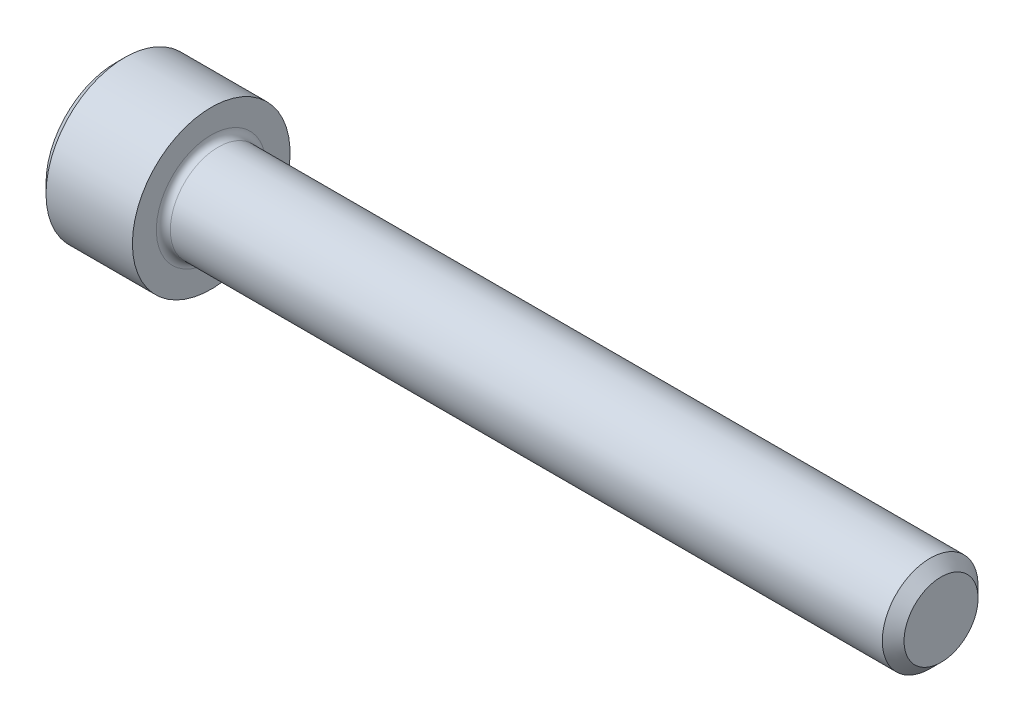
from build123d import *

# Parameters (mm, degrees)
FILLET1_R   = 0.3048
HEX_2_DEPTH = 1.9558


with BuildPart() as part:
    # BodySke → Base-Revolve (revolve)
    with BuildSketch(Plane.XY, mode=Mode.PRIVATE) as base_revolve_sk:
        Polygon((0, 0), (0, 3.0226), (0.4064, 3.429), (4.1656, 3.429), (4.1656, 2.0828), (35.44316, 2.0828), (35.9156, 1.61036), (35.9156, 0), align=None)
    revolve(base_revolve_sk.sketch.rotate(Axis((-31.75, 0, 0), (1, 0, 0)), 90), axis=Axis((-31.75, 0, 0), (1, 0, 0)))

    # Fillet1
    fillet1_edges = [part.edges().sort_by_distance(p)[0] for p in [
        (4.1656, 0, -2.0828),
    ]]
    fillet(fillet1_edges, radius=FILLET1_R)

    # Sketch2 → Hex-PreBroach (revolve, cut)
    with BuildSketch(Plane.XY, mode=Mode.PRIVATE) as hex_prebroach_sk:
        Polygon((0, 1.778), (1.9558, 1.778), (2.982328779, 0), (0, 0), align=None)
    revolve(hex_prebroach_sk.sketch.rotate(Axis((0, 0, 0), (1, 0, 0)), 90), axis=Axis((0, 0, 0), (1, 0, 0)), mode=Mode.SUBTRACT)

    # Sketch3 → Hex 2 (cut)
    with BuildSketch(Plane(origin=(0, 0, 0), x_dir=(0, 0.500000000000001, 0.866025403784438), z_dir=(-1, 0, 0))):
        Polygon((1.026528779, 1.778), (-1.026528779, 1.778), (-2.053057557, 0), (-1.026528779, -1.778), (1.026528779, -1.778), (2.053057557, 0), align=None)
    extrude(amount=-HEX_2_DEPTH, mode=Mode.SUBTRACT)


solid = part.part
